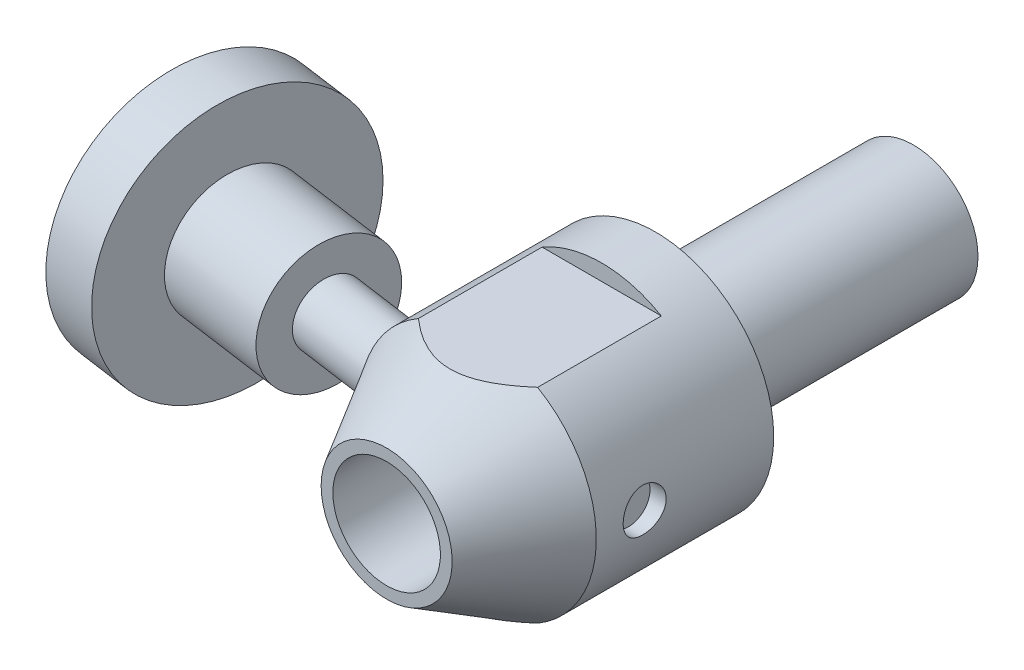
ISO-10303-21;
HEADER;
FILE_DESCRIPTION(('STEP AP214'),'2;1');
FILE_NAME('part.step','',(''),(''),'','','');
FILE_SCHEMA(('AUTOMOTIVE_DESIGN { 1 0 10303 214 1 1 1 1 }'));
ENDSEC;
DATA;
#1=APPLICATION_CONTEXT('core data for automotive mechanical design processes');
#2=APPLICATION_PROTOCOL_DEFINITION('international standard','automotive_design',2000,#1);
#3=PRODUCT_CONTEXT('',#1,'mechanical');
#4=PRODUCT('Part','Part','',(#3));
#5=PRODUCT_RELATED_PRODUCT_CATEGORY('part','',(#4));
#6=PRODUCT_DEFINITION_FORMATION('','',#4);
#7=PRODUCT_DEFINITION_CONTEXT('part definition',#1,'design');
#8=PRODUCT_DEFINITION('design','',#6,#7);
#9=PRODUCT_DEFINITION_SHAPE('','',#8);
#10=(LENGTH_UNIT() NAMED_UNIT(*) SI_UNIT(.MILLI.,.METRE.));
#11=(NAMED_UNIT(*) PLANE_ANGLE_UNIT() SI_UNIT($,.RADIAN.));
#12=(NAMED_UNIT(*) SI_UNIT($,.STERADIAN.) SOLID_ANGLE_UNIT());
#13=UNCERTAINTY_MEASURE_WITH_UNIT(LENGTH_MEASURE(1.E-05),#10,'distance_accuracy_value','');
#14=(GEOMETRIC_REPRESENTATION_CONTEXT(3) GLOBAL_UNCERTAINTY_ASSIGNED_CONTEXT((#13)) GLOBAL_UNIT_ASSIGNED_CONTEXT((#10,
#11,#12)) REPRESENTATION_CONTEXT('',''));
#15=CARTESIAN_POINT('',(0.,0.,0.));
#16=DIRECTION('',(0.,0.,1.));
#17=DIRECTION('',(1.,0.,0.));
#18=AXIS2_PLACEMENT_3D('',#15,#16,#17);
#19=CARTESIAN_POINT('',(9.5,0.,14.));
#20=DIRECTION('',(-1.,0.,0.));
#21=DIRECTION('',(0.,0.,1.));
#22=AXIS2_PLACEMENT_3D('',#19,#20,#21);
#23=PLANE('',#22);
#24=CARTESIAN_POINT('',(9.5,0.,12.));
#25=DIRECTION('',(1.,0.,0.));
#26=DIRECTION('',(0.,0.,-1.));
#27=AXIS2_PLACEMENT_3D('',#24,#25,#26);
#28=CIRCLE('',#27,2.);
#29=CARTESIAN_POINT('',(9.5,0.,10.));
#30=VERTEX_POINT('',#29);
#31=EDGE_CURVE('E59',#30,#30,#28,.T.);
#32=ORIENTED_EDGE('',*,*,#31,.T.);
#33=EDGE_LOOP('',(#32));
#34=FACE_BOUND('',#33,.T.);
#35=ADVANCED_FACE('F14',(#34),#23,.F.);
#36=CARTESIAN_POINT('',(-29.4859678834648,0.,9.40196664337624));
#37=DIRECTION('',(0.99026806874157,0.,0.139173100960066));
#38=DIRECTION('',(0.139173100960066,0.,-0.99026806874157));
#39=AXIS2_PLACEMENT_3D('',#36,#37,#38);
#40=PLANE('',#39);
#41=CARTESIAN_POINT('',(-29.4859678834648,0.,9.40196664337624));
#42=DIRECTION('',(-0.99026806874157,0.,-0.139173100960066));
#43=DIRECTION('',(-0.139173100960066,0.,0.99026806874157));
#44=AXIS2_PLACEMENT_3D('',#41,#42,#43);
#45=CIRCLE('',#44,3.);
#46=CARTESIAN_POINT('',(-29.0684485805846,0.,6.43116243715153));
#47=VERTEX_POINT('',#46);
#48=EDGE_CURVE('E137',#47,#47,#45,.T.);
#49=ORIENTED_EDGE('',*,*,#48,.T.);
#50=EDGE_LOOP('',(#49));
#51=FACE_BOUND('',#50,.T.);
#52=ADVANCED_FACE('F114',(#51),#40,.F.);
#53=CARTESIAN_POINT('',(-34.4373082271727,0.,8.70610113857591));
#54=DIRECTION('',(0.99026806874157,0.,0.139173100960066));
#55=DIRECTION('',(0.139173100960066,0.,-0.99026806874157));
#56=AXIS2_PLACEMENT_3D('',#53,#54,#55);
#57=CYLINDRICAL_SURFACE('',#56,3.);
#58=CARTESIAN_POINT('',(-34.4373082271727,0.,8.70610113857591));
#59=DIRECTION('',(0.99026806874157,0.,0.139173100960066));
#60=DIRECTION('',(0.139173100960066,0.,-0.99026806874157));
#61=AXIS2_PLACEMENT_3D('',#58,#59,#60);
#62=CIRCLE('',#61,3.);
#63=CARTESIAN_POINT('',(-34.0197889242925,0.,5.7352969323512));
#64=VERTEX_POINT('',#63);
#65=EDGE_CURVE('E221',#64,#64,#62,.T.);
#66=CARTESIAN_POINT('',(-34.0197889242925,0.,5.7352969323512));
#67=CARTESIAN_POINT('',(-33.9682124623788,0.,5.74254553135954));
#68=CARTESIAN_POINT('',(-33.9166360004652,0.,5.74979413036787));
#69=CARTESIAN_POINT('',(-33.813483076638,0.,5.76429132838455));
#70=CARTESIAN_POINT('',(-33.7619066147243,0.,5.77153992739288));
#71=CARTESIAN_POINT('',(-33.6587536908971,0.,5.78603712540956));
#72=CARTESIAN_POINT('',(-33.6071772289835,0.,5.79328572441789));
#73=CARTESIAN_POINT('',(-33.5040243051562,0.,5.80778292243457));
#74=CARTESIAN_POINT('',(-33.4524478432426,0.,5.81503152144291));
#75=CARTESIAN_POINT('',(-33.3492949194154,0.,5.82952871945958));
#76=CARTESIAN_POINT('',(-33.2977184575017,0.,5.83677731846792));
#77=CARTESIAN_POINT('',(-33.1945655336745,0.,5.85127451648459));
#78=CARTESIAN_POINT('',(-33.1429890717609,0.,5.85852311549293));
#79=CARTESIAN_POINT('',(-33.0398361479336,0.,5.8730203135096));
#80=CARTESIAN_POINT('',(-32.98825968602,0.,5.88026891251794));
#81=CARTESIAN_POINT('',(-32.8851067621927,0.,5.89476611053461));
#82=CARTESIAN_POINT('',(-32.8335303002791,0.,5.90201470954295));
#83=CARTESIAN_POINT('',(-32.7303773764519,0.,5.91651190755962));
#84=CARTESIAN_POINT('',(-32.6788009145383,0.,5.92376050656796));
#85=CARTESIAN_POINT('',(-32.575647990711,0.,5.93825770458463));
#86=CARTESIAN_POINT('',(-32.5240715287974,0.,5.94550630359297));
#87=CARTESIAN_POINT('',(-32.4209186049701,0.,5.96000350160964));
#88=CARTESIAN_POINT('',(-32.3693421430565,0.,5.96725210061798));
#89=CARTESIAN_POINT('',(-32.2661892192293,0.,5.98174929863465));
#90=CARTESIAN_POINT('',(-32.2146127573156,0.,5.98899789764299));
#91=CARTESIAN_POINT('',(-32.1114598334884,0.,6.00349509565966));
#92=CARTESIAN_POINT('',(-32.0598833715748,0.,6.010743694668));
#93=CARTESIAN_POINT('',(-31.9567304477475,0.,6.02524089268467));
#94=CARTESIAN_POINT('',(-31.9051539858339,0.,6.03248949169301));
#95=CARTESIAN_POINT('',(-31.8020010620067,0.,6.04698668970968));
#96=CARTESIAN_POINT('',(-31.750424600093,0.,6.05423528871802));
#97=CARTESIAN_POINT('',(-31.6472716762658,0.,6.06873248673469));
#98=CARTESIAN_POINT('',(-31.5956952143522,0.,6.07598108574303));
#99=CARTESIAN_POINT('',(-31.4925422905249,0.,6.0904782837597));
#100=CARTESIAN_POINT('',(-31.4409658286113,0.,6.09772688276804));
#101=CARTESIAN_POINT('',(-31.337812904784,0.,6.11222408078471));
#102=CARTESIAN_POINT('',(-31.2862364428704,0.,6.11947267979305));
#103=CARTESIAN_POINT('',(-31.1830835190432,0.,6.13396987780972));
#104=CARTESIAN_POINT('',(-31.1315070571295,0.,6.14121847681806));
#105=CARTESIAN_POINT('',(-31.0283541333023,0.,6.15571567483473));
#106=CARTESIAN_POINT('',(-30.9767776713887,0.,6.16296427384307));
#107=CARTESIAN_POINT('',(-30.8736247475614,0.,6.17746147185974));
#108=CARTESIAN_POINT('',(-30.8220482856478,0.,6.18471007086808));
#109=CARTESIAN_POINT('',(-30.7188953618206,0.,6.19920726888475));
#110=CARTESIAN_POINT('',(-30.6673188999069,0.,6.20645586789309));
#111=CARTESIAN_POINT('',(-30.5641659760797,0.,6.22095306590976));
#112=CARTESIAN_POINT('',(-30.5125895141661,0.,6.2282016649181));
#113=CARTESIAN_POINT('',(-30.4094365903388,0.,6.24269886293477));
#114=CARTESIAN_POINT('',(-30.3578601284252,0.,6.24994746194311));
#115=CARTESIAN_POINT('',(-30.2547072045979,0.,6.26444465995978));
#116=CARTESIAN_POINT('',(-30.2031307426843,0.,6.27169325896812));
#117=CARTESIAN_POINT('',(-30.0999778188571,0.,6.2861904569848));
#118=CARTESIAN_POINT('',(-30.0484013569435,0.,6.29343905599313));
#119=CARTESIAN_POINT('',(-29.9452484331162,0.,6.30793625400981));
#120=CARTESIAN_POINT('',(-29.8936719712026,0.,6.31518485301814));
#121=CARTESIAN_POINT('',(-29.7905190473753,0.,6.32968205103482));
#122=CARTESIAN_POINT('',(-29.7389425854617,0.,6.33693065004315));
#123=CARTESIAN_POINT('',(-29.6357896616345,0.,6.35142784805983));
#124=CARTESIAN_POINT('',(-29.5842131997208,0.,6.35867644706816));
#125=CARTESIAN_POINT('',(-29.4810602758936,0.,6.37317364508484));
#126=CARTESIAN_POINT('',(-29.42948381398,0.,6.38042224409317));
#127=CARTESIAN_POINT('',(-29.3263308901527,0.,6.39491944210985));
#128=CARTESIAN_POINT('',(-29.2747544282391,0.,6.40216804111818));
#129=CARTESIAN_POINT('',(-29.1716015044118,0.,6.41666523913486));
#130=CARTESIAN_POINT('',(-29.1200250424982,0.,6.42391383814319));
#131=CARTESIAN_POINT('',(-29.0684485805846,0.,6.43116243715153));
#132=B_SPLINE_CURVE_WITH_KNOTS('',3,(#66,#67,#68,#69,#70,#71,#72,#73,#74,#75,#76,#77,#78,#79,
#80,#81,#82,#83,#84,#85,#86,#87,#88,#89,#90,#91,#92,#93,#94,#95,#96,#97,#98,#99,#100,#101,#102,
#103,#104,#105,#106,#107,#108,#109,#110,#111,#112,#113,#114,#115,#116,#117,#118,#119,#120,#121,
#122,#123,#124,#125,#126,#127,#128,#129,#130,#131),.UNSPECIFIED.,.F.,.F.,(4,2,2,2,2,2,2,2,2,2,2,
2,2,2,2,2,2,2,2,2,2,2,2,2,2,2,2,2,2,2,2,2,4),(0.,0.156250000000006,0.312500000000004,
0.468750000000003,0.625000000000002,0.781250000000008,0.937500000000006,1.09375000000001,1.25,
1.40625,1.56250000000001,1.71875000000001,1.87500000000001,2.03125,2.1875,2.34375000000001,
2.50000000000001,2.65625000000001,2.81250000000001,2.96875000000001,3.12500000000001,
3.28125000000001,3.43750000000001,3.59375000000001,3.75000000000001,3.90625000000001,
4.06250000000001,4.21875000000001,4.37500000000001,4.53125000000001,4.68750000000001,
4.84375000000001,5.00000000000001),.UNSPECIFIED.);
#133=EDGE_CURVE('BSEAM118',#64,#47,#132,.T.);
#134=ORIENTED_EDGE('',*,*,#65,.F.);
#135=ORIENTED_EDGE('',*,*,#48,.F.);
#136=ORIENTED_EDGE('',*,*,#133,.T.);
#137=ORIENTED_EDGE('',*,*,#133,.F.);
#138=EDGE_LOOP('',(#134,#136,#135,#137));
#139=FACE_BOUND('',#138,.T.);
#140=ADVANCED_FACE('F118',(#139),#57,.F.);
#141=CARTESIAN_POINT('',(-34.4373082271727,12.,8.70610113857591));
#142=DIRECTION('',(-0.99026806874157,0.,-0.139173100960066));
#143=DIRECTION('',(-0.139173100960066,0.,0.99026806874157));
#144=AXIS2_PLACEMENT_3D('',#141,#142,#143);
#145=PLANE('',#144);
#146=ORIENTED_EDGE('',*,*,#65,.T.);
#147=EDGE_LOOP('',(#146));
#148=FACE_BOUND('',#147,.T.);
#149=CARTESIAN_POINT('',(-34.4373082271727,0.,8.70610113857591));
#150=DIRECTION('',(0.99026806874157,0.,0.139173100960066));
#151=DIRECTION('',(0.139173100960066,0.,-0.99026806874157));
#152=AXIS2_PLACEMENT_3D('',#149,#150,#151);
#153=CIRCLE('',#152,12.);
#154=CARTESIAN_POINT('',(-32.7672310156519,0.,-3.17711568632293));
#155=VERTEX_POINT('',#154);
#156=EDGE_CURVE('E226',#155,#155,#153,.T.);
#157=ORIENTED_EDGE('',*,*,#156,.F.);
#158=EDGE_LOOP('',(#157));
#159=FACE_BOUND('',#158,.T.);
#160=ADVANCED_FACE('F245',(#148,#159),#145,.T.);
#161=CARTESIAN_POINT('',(-9.68060650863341,0.,12.1854286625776));
#162=DIRECTION('',(0.99026806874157,0.,0.139173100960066));
#163=DIRECTION('',(0.139173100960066,0.,-0.99026806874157));
#164=AXIS2_PLACEMENT_3D('',#161,#162,#163);
#165=CYLINDRICAL_SURFACE('',#164,12.);
#166=CARTESIAN_POINT('',(-29.4859678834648,0.,9.40196664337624));
#167=DIRECTION('',(0.99026806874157,0.,0.139173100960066));
#168=DIRECTION('',(0.139173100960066,0.,-0.99026806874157));
#169=AXIS2_PLACEMENT_3D('',#166,#167,#168);
#170=CIRCLE('',#169,12.);
#171=CARTESIAN_POINT('',(-27.8158906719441,0.,-2.48125018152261));
#172=VERTEX_POINT('',#171);
#173=EDGE_CURVE('E233',#172,#172,#170,.T.);
#174=CARTESIAN_POINT('',(-32.7672310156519,0.,-3.17711568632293));
#175=CARTESIAN_POINT('',(-32.7156545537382,0.,-3.16986708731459));
#176=CARTESIAN_POINT('',(-32.6640780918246,0.,-3.16261848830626));
#177=CARTESIAN_POINT('',(-32.5609251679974,0.,-3.14812129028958));
#178=CARTESIAN_POINT('',(-32.5093487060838,0.,-3.14087269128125));
#179=CARTESIAN_POINT('',(-32.4061957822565,0.,-3.12637549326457));
#180=CARTESIAN_POINT('',(-32.3546193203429,0.,-3.11912689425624));
#181=CARTESIAN_POINT('',(-32.2514663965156,0.,-3.10462969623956));
#182=CARTESIAN_POINT('',(-32.199889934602,0.,-3.09738109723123));
#183=CARTESIAN_POINT('',(-32.0967370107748,0.,-3.08288389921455));
#184=CARTESIAN_POINT('',(-32.0451605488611,0.,-3.07563530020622));
#185=CARTESIAN_POINT('',(-31.9420076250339,0.,-3.06113810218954));
#186=CARTESIAN_POINT('',(-31.8904311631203,0.,-3.05388950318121));
#187=CARTESIAN_POINT('',(-31.787278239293,0.,-3.03939230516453));
#188=CARTESIAN_POINT('',(-31.7357017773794,0.,-3.0321437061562));
#189=CARTESIAN_POINT('',(-31.6325488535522,0.,-3.01764650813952));
#190=CARTESIAN_POINT('',(-31.5809723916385,0.,-3.01039790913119));
#191=CARTESIAN_POINT('',(-31.4778194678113,0.,-2.99590071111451));
#192=CARTESIAN_POINT('',(-31.4262430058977,0.,-2.98865211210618));
#193=CARTESIAN_POINT('',(-31.3230900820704,0.,-2.9741549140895));
#194=CARTESIAN_POINT('',(-31.2715136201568,0.,-2.96690631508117));
#195=CARTESIAN_POINT('',(-31.1683606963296,0.,-2.95240911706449));
#196=CARTESIAN_POINT('',(-31.1167842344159,0.,-2.94516051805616));
#197=CARTESIAN_POINT('',(-31.0136313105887,0.,-2.93066332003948));
#198=CARTESIAN_POINT('',(-30.9620548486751,0.,-2.92341472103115));
#199=CARTESIAN_POINT('',(-30.8589019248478,0.,-2.90891752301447));
#200=CARTESIAN_POINT('',(-30.8073254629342,0.,-2.90166892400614));
#201=CARTESIAN_POINT('',(-30.7041725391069,0.,-2.88717172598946));
#202=CARTESIAN_POINT('',(-30.6525960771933,0.,-2.87992312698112));
#203=CARTESIAN_POINT('',(-30.5494431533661,0.,-2.86542592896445));
#204=CARTESIAN_POINT('',(-30.4978666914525,0.,-2.85817732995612));
#205=CARTESIAN_POINT('',(-30.3947137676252,0.,-2.84368013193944));
#206=CARTESIAN_POINT('',(-30.3431373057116,0.,-2.83643153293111));
#207=CARTESIAN_POINT('',(-30.2399843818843,0.,-2.82193433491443));
#208=CARTESIAN_POINT('',(-30.1884079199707,0.,-2.8146857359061));
#209=CARTESIAN_POINT('',(-30.0852549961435,0.,-2.80018853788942));
#210=CARTESIAN_POINT('',(-30.0336785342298,0.,-2.79293993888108));
#211=CARTESIAN_POINT('',(-29.9305256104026,0.,-2.77844274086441));
#212=CARTESIAN_POINT('',(-29.878949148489,0.,-2.77119414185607));
#213=CARTESIAN_POINT('',(-29.7757962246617,0.,-2.7566969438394));
#214=CARTESIAN_POINT('',(-29.7242197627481,0.,-2.74944834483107));
#215=CARTESIAN_POINT('',(-29.6210668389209,0.,-2.73495114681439));
#216=CARTESIAN_POINT('',(-29.5694903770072,0.,-2.72770254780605));
#217=CARTESIAN_POINT('',(-29.46633745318,0.,-2.71320534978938));
#218=CARTESIAN_POINT('',(-29.4147609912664,0.,-2.70595675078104));
#219=CARTESIAN_POINT('',(-29.3116080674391,0.,-2.69145955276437));
#220=CARTESIAN_POINT('',(-29.2600316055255,0.,-2.68421095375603));
#221=CARTESIAN_POINT('',(-29.1568786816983,0.,-2.66971375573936));
#222=CARTESIAN_POINT('',(-29.1053022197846,0.,-2.66246515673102));
#223=CARTESIAN_POINT('',(-29.0021492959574,0.,-2.64796795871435));
#224=CARTESIAN_POINT('',(-28.9505728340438,0.,-2.64071935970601));
#225=CARTESIAN_POINT('',(-28.8474199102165,0.,-2.62622216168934));
#226=CARTESIAN_POINT('',(-28.7958434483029,0.,-2.618973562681));
#227=CARTESIAN_POINT('',(-28.6926905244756,0.,-2.60447636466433));
#228=CARTESIAN_POINT('',(-28.641114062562,0.,-2.59722776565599));
#229=CARTESIAN_POINT('',(-28.5379611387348,0.,-2.58273056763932));
#230=CARTESIAN_POINT('',(-28.4863846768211,0.,-2.57548196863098));
#231=CARTESIAN_POINT('',(-28.3832317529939,0.,-2.56098477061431));
#232=CARTESIAN_POINT('',(-28.3316552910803,0.,-2.55373617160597));
#233=CARTESIAN_POINT('',(-28.228502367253,0.,-2.5392389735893));
#234=CARTESIAN_POINT('',(-28.1769259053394,0.,-2.53199037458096));
#235=CARTESIAN_POINT('',(-28.0737729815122,0.,-2.51749317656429));
#236=CARTESIAN_POINT('',(-28.0221965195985,0.,-2.51024457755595));
#237=CARTESIAN_POINT('',(-27.9190435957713,0.,-2.49574737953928));
#238=CARTESIAN_POINT('',(-27.8674671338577,0.,-2.48849878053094));
#239=CARTESIAN_POINT('',(-27.8158906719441,0.,-2.48125018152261));
#240=B_SPLINE_CURVE_WITH_KNOTS('',3,(#174,#175,#176,#177,#178,#179,#180,#181,#182,#183,#184,
#185,#186,#187,#188,#189,#190,#191,#192,#193,#194,#195,#196,#197,#198,#199,#200,#201,#202,#203,
#204,#205,#206,#207,#208,#209,#210,#211,#212,#213,#214,#215,#216,#217,#218,#219,#220,#221,#222,
#223,#224,#225,#226,#227,#228,#229,#230,#231,#232,#233,#234,#235,#236,#237,#238,#239),
.UNSPECIFIED.,.F.,.F.,(4,2,2,2,2,2,2,2,2,2,2,2,2,2,2,2,2,2,2,2,2,2,2,2,2,2,2,2,2,2,2,2,4),(0.,
0.156249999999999,0.312499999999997,0.468749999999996,0.624999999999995,0.781249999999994,
0.937499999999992,1.09374999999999,1.24999999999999,1.40624999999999,1.56249999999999,
1.71874999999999,1.87499999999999,2.03124999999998,2.18749999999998,2.34374999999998,
2.49999999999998,2.65624999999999,2.81249999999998,2.96874999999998,3.12499999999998,
3.28124999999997,3.43749999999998,3.59374999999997,3.74999999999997,3.90624999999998,
4.06249999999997,4.21874999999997,4.37499999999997,4.53124999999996,4.68749999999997,
4.84374999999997,4.99999999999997),.UNSPECIFIED.);
#241=EDGE_CURVE('BSEAM120',#155,#172,#240,.T.);
#242=ORIENTED_EDGE('',*,*,#156,.T.);
#243=ORIENTED_EDGE('',*,*,#173,.F.);
#244=ORIENTED_EDGE('',*,*,#241,.T.);
#245=ORIENTED_EDGE('',*,*,#241,.F.);
#246=EDGE_LOOP('',(#242,#244,#243,#245));
#247=FACE_BOUND('',#246,.T.);
#248=ADVANCED_FACE('F120',(#247),#165,.T.);
#249=CARTESIAN_POINT('',(-29.4859678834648,6.,9.40196664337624));
#250=DIRECTION('',(0.99026806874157,0.,0.139173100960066));
#251=DIRECTION('',(0.139173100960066,0.,-0.99026806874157));
#252=AXIS2_PLACEMENT_3D('',#249,#250,#251);
#253=PLANE('',#252);
#254=ORIENTED_EDGE('',*,*,#173,.T.);
#255=EDGE_LOOP('',(#254));
#256=FACE_BOUND('',#255,.T.);
#257=CARTESIAN_POINT('',(-29.4859678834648,0.,9.40196664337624));
#258=DIRECTION('',(0.99026806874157,0.,0.139173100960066));
#259=DIRECTION('',(0.139173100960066,0.,-0.99026806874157));
#260=AXIS2_PLACEMENT_3D('',#257,#258,#259);
#261=CIRCLE('',#260,6.);
#262=CARTESIAN_POINT('',(-28.6509292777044,0.,3.46035823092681));
#263=VERTEX_POINT('',#262);
#264=EDGE_CURVE('E235',#263,#263,#261,.T.);
#265=ORIENTED_EDGE('',*,*,#264,.F.);
#266=EDGE_LOOP('',(#265));
#267=FACE_BOUND('',#266,.T.);
#268=ADVANCED_FACE('F194',(#256,#267),#253,.T.);
#269=CARTESIAN_POINT('',(4.5,0.,-24.));
#270=DIRECTION('',(0.,0.,1.));
#271=DIRECTION('',(1.,0.,0.));
#272=AXIS2_PLACEMENT_3D('',#269,#270,#271);
#273=PLANE('',#272);
#274=CARTESIAN_POINT('',(0.,0.,-24.));
#275=DIRECTION('',(0.,0.,1.));
#276=DIRECTION('',(1.,0.,0.));
#277=AXIS2_PLACEMENT_3D('',#274,#275,#276);
#278=CIRCLE('',#277,6.);
#279=CARTESIAN_POINT('',(6.,0.,-24.));
#280=VERTEX_POINT('',#279);
#281=EDGE_CURVE('E140',#280,#280,#278,.F.);
#282=ORIENTED_EDGE('',*,*,#281,.T.);
#283=EDGE_LOOP('',(#282));
#284=FACE_BOUND('',#283,.T.);
#285=ADVANCED_FACE('F16',(#284),#273,.F.);
#286=CARTESIAN_POINT('',(-9.68060650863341,0.,12.1854286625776));
#287=DIRECTION('',(0.99026806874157,0.,0.139173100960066));
#288=DIRECTION('',(0.139173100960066,0.,-0.99026806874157));
#289=AXIS2_PLACEMENT_3D('',#286,#287,#288);
#290=CYLINDRICAL_SURFACE('',#289,6.);
#291=CARTESIAN_POINT('',(-19.5832871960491,0.,10.7936976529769));
#292=DIRECTION('',(0.99026806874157,0.,0.139173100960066));
#293=DIRECTION('',(0.139173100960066,0.,-0.99026806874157));
#294=AXIS2_PLACEMENT_3D('',#291,#292,#293);
#295=CIRCLE('',#294,6.);
#296=CARTESIAN_POINT('',(-18.7482485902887,0.,4.85208924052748));
#297=VERTEX_POINT('',#296);
#298=EDGE_CURVE('E138',#297,#297,#295,.T.);
#299=CARTESIAN_POINT('',(-28.6509292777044,0.,3.46035823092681));
#300=CARTESIAN_POINT('',(-28.5477763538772,0.,3.47485542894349));
#301=CARTESIAN_POINT('',(-28.44462343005,0.,3.48935262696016));
#302=CARTESIAN_POINT('',(-28.2383175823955,0.,3.51834702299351));
#303=CARTESIAN_POINT('',(-28.1351646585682,0.,3.53284422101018));
#304=CARTESIAN_POINT('',(-27.9288588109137,0.,3.56183861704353));
#305=CARTESIAN_POINT('',(-27.8257058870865,0.,3.5763358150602));
#306=CARTESIAN_POINT('',(-27.619400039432,0.,3.60533021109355));
#307=CARTESIAN_POINT('',(-27.5162471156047,0.,3.61982740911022));
#308=CARTESIAN_POINT('',(-27.3099412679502,0.,3.64882180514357));
#309=CARTESIAN_POINT('',(-27.206788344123,0.,3.66331900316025));
#310=CARTESIAN_POINT('',(-27.0004824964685,0.,3.69231339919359));
#311=CARTESIAN_POINT('',(-26.8973295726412,0.,3.70681059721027));
#312=CARTESIAN_POINT('',(-26.6910237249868,0.,3.73580499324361));
#313=CARTESIAN_POINT('',(-26.5878708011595,0.,3.75030219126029));
#314=CARTESIAN_POINT('',(-26.381564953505,0.,3.77929658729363));
#315=CARTESIAN_POINT('',(-26.2784120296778,0.,3.79379378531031));
#316=CARTESIAN_POINT('',(-26.0721061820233,0.,3.82278818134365));
#317=CARTESIAN_POINT('',(-25.968953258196,0.,3.83728537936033));
#318=CARTESIAN_POINT('',(-25.7626474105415,0.,3.86627977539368));
#319=CARTESIAN_POINT('',(-25.6594944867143,0.,3.88077697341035));
#320=CARTESIAN_POINT('',(-25.4531886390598,0.,3.9097713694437));
#321=CARTESIAN_POINT('',(-25.3500357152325,0.,3.92426856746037));
#322=CARTESIAN_POINT('',(-25.143729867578,0.,3.95326296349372));
#323=CARTESIAN_POINT('',(-25.0405769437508,0.,3.96776016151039));
#324=CARTESIAN_POINT('',(-24.8342710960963,0.,3.99675455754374));
#325=CARTESIAN_POINT('',(-24.7311181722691,0.,4.01125175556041));
#326=CARTESIAN_POINT('',(-24.5248123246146,0.,4.04024615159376));
#327=CARTESIAN_POINT('',(-24.4216594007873,0.,4.05474334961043));
#328=CARTESIAN_POINT('',(-24.2153535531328,0.,4.08373774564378));
#329=CARTESIAN_POINT('',(-24.1122006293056,0.,4.09823494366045));
#330=CARTESIAN_POINT('',(-23.9058947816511,0.,4.1272293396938));
#331=CARTESIAN_POINT('',(-23.8027418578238,0.,4.14172653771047));
#332=CARTESIAN_POINT('',(-23.5964360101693,0.,4.17072093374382));
#333=CARTESIAN_POINT('',(-23.4932830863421,0.,4.18521813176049));
#334=CARTESIAN_POINT('',(-23.2869772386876,0.,4.21421252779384));
#335=CARTESIAN_POINT('',(-23.1838243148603,0.,4.22870972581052));
#336=CARTESIAN_POINT('',(-22.9775184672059,0.,4.25770412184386));
#337=CARTESIAN_POINT('',(-22.8743655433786,0.,4.27220131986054));
#338=CARTESIAN_POINT('',(-22.6680596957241,0.,4.30119571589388));
#339=CARTESIAN_POINT('',(-22.5649067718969,0.,4.31569291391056));
#340=CARTESIAN_POINT('',(-22.3586009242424,0.,4.3446873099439));
#341=CARTESIAN_POINT('',(-22.2554480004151,0.,4.35918450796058));
#342=CARTESIAN_POINT('',(-22.0491421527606,0.,4.38817890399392));
#343=CARTESIAN_POINT('',(-21.9459892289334,0.,4.4026761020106));
#344=CARTESIAN_POINT('',(-21.7396833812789,0.,4.43167049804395));
#345=CARTESIAN_POINT('',(-21.6365304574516,0.,4.44616769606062));
#346=CARTESIAN_POINT('',(-21.4302246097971,0.,4.47516209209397));
#347=CARTESIAN_POINT('',(-21.3270716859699,0.,4.48965929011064));
#348=CARTESIAN_POINT('',(-21.1207658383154,0.,4.51865368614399));
#349=CARTESIAN_POINT('',(-21.0176129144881,0.,4.53315088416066));
#350=CARTESIAN_POINT('',(-20.8113070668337,0.,4.56214528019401));
#351=CARTESIAN_POINT('',(-20.7081541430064,0.,4.57664247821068));
#352=CARTESIAN_POINT('',(-20.5018482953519,0.,4.60563687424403));
#353=CARTESIAN_POINT('',(-20.3986953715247,0.,4.6201340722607));
#354=CARTESIAN_POINT('',(-20.1923895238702,0.,4.64912846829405));
#355=CARTESIAN_POINT('',(-20.0892366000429,0.,4.66362566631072));
#356=CARTESIAN_POINT('',(-19.8829307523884,0.,4.69262006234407));
#357=CARTESIAN_POINT('',(-19.7797778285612,0.,4.70711726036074));
#358=CARTESIAN_POINT('',(-19.5734719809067,0.,4.73611165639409));
#359=CARTESIAN_POINT('',(-19.4703190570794,0.,4.75060885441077));
#360=CARTESIAN_POINT('',(-19.2640132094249,0.,4.77960325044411));
#361=CARTESIAN_POINT('',(-19.1608602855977,0.,4.79410044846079));
#362=CARTESIAN_POINT('',(-18.9545544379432,0.,4.82309484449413));
#363=CARTESIAN_POINT('',(-18.851401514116,0.,4.83759204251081));
#364=CARTESIAN_POINT('',(-18.7482485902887,0.,4.85208924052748));
#365=B_SPLINE_CURVE_WITH_KNOTS('',3,(#299,#300,#301,#302,#303,#304,#305,#306,#307,#308,#309,
#310,#311,#312,#313,#314,#315,#316,#317,#318,#319,#320,#321,#322,#323,#324,#325,#326,#327,#328,
#329,#330,#331,#332,#333,#334,#335,#336,#337,#338,#339,#340,#341,#342,#343,#344,#345,#346,#347,
#348,#349,#350,#351,#352,#353,#354,#355,#356,#357,#358,#359,#360,#361,#362,#363,#364),
.UNSPECIFIED.,.F.,.F.,(4,2,2,2,2,2,2,2,2,2,2,2,2,2,2,2,2,2,2,2,2,2,2,2,2,2,2,2,2,2,2,2,4),(0.,
0.312499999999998,0.625000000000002,0.9375,1.25,1.5625,1.87500000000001,2.1875,2.50000000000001,
2.81250000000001,3.12500000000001,3.43750000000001,3.75000000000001,4.06250000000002,
4.37500000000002,4.68750000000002,5.00000000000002,5.31250000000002,5.62500000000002,
5.93750000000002,6.25000000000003,6.56250000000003,6.87500000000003,7.18750000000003,
7.50000000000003,7.81250000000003,8.12500000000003,8.43750000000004,8.75000000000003,
9.06250000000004,9.37500000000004,9.68750000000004,10.),.UNSPECIFIED.);
#366=EDGE_CURVE('BSEAM165',#263,#297,#365,.T.);
#367=ORIENTED_EDGE('',*,*,#264,.T.);
#368=ORIENTED_EDGE('',*,*,#298,.F.);
#369=ORIENTED_EDGE('',*,*,#366,.T.);
#370=ORIENTED_EDGE('',*,*,#366,.F.);
#371=EDGE_LOOP('',(#367,#369,#368,#370));
#372=FACE_BOUND('',#371,.T.);
#373=ADVANCED_FACE('F165',(#372),#290,.T.);
#374=CARTESIAN_POINT('',(2.1,0.,3.));
#375=DIRECTION('',(0.,0.,-1.));
#376=DIRECTION('',(-1.,0.,0.));
#377=AXIS2_PLACEMENT_3D('',#374,#375,#376);
#378=PLANE('',#377);
#379=CARTESIAN_POINT('',(0.,0.,3.));
#380=DIRECTION('',(0.,0.,-1.));
#381=DIRECTION('',(-1.,0.,0.));
#382=AXIS2_PLACEMENT_3D('',#379,#380,#381);
#383=CIRCLE('',#382,5.);
#384=CARTESIAN_POINT('',(-5.,0.,3.));
#385=VERTEX_POINT('',#384);
#386=EDGE_CURVE('E154',#385,#385,#383,.T.);
#387=ORIENTED_EDGE('',*,*,#386,.F.);
#388=EDGE_LOOP('',(#387));
#389=FACE_BOUND('',#388,.T.);
#390=ADVANCED_FACE('F127',(#389),#378,.F.);
#391=CARTESIAN_POINT('',(5.,0.,25.));
#392=DIRECTION('',(0.,0.,-1.));
#393=DIRECTION('',(-1.,0.,0.));
#394=AXIS2_PLACEMENT_3D('',#391,#392,#393);
#395=PLANE('',#394);
#396=CARTESIAN_POINT('',(0.,0.,25.));
#397=DIRECTION('',(0.,0.,-1.));
#398=DIRECTION('',(-1.,0.,0.));
#399=AXIS2_PLACEMENT_3D('',#396,#397,#398);
#400=CIRCLE('',#399,6.09252271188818);
#401=CARTESIAN_POINT('',(-6.09252271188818,0.,25.));
#402=VERTEX_POINT('',#401);
#403=EDGE_CURVE('E209',#402,#402,#400,.T.);
#404=ORIENTED_EDGE('',*,*,#403,.F.);
#405=EDGE_LOOP('',(#404));
#406=FACE_BOUND('',#405,.T.);
#407=CARTESIAN_POINT('',(0.,0.,25.));
#408=DIRECTION('',(0.,0.,-1.));
#409=DIRECTION('',(-1.,0.,0.));
#410=AXIS2_PLACEMENT_3D('',#407,#408,#409);
#411=CIRCLE('',#410,5.);
#412=CARTESIAN_POINT('',(-5.,0.,25.));
#413=VERTEX_POINT('',#412);
#414=EDGE_CURVE('E213',#413,#413,#411,.T.);
#415=ORIENTED_EDGE('',*,*,#414,.T.);
#416=EDGE_LOOP('',(#415));
#417=FACE_BOUND('',#416,.T.);
#418=ADVANCED_FACE('F145',(#406,#417),#395,.F.);
#419=CARTESIAN_POINT('',(0.,0.,-48.3091160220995));
#420=DIRECTION('',(0.,0.,-1.));
#421=DIRECTION('',(-1.,0.,0.));
#422=AXIS2_PLACEMENT_3D('',#419,#420,#421);
#423=CYLINDRICAL_SURFACE('',#422,5.);
#424=ORIENTED_EDGE('',*,*,#414,.F.);
#425=EDGE_LOOP('',(#424));
#426=FACE_BOUND('',#425,.T.);
#427=ORIENTED_EDGE('',*,*,#386,.T.);
#428=EDGE_LOOP('',(#427));
#429=FACE_BOUND('',#428,.T.);
#430=ADVANCED_FACE('F167',(#426,#429),#423,.F.);
#431=CARTESIAN_POINT('',(0.,0.,-48.3091160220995));
#432=DIRECTION('',(0.,0.,-1.));
#433=DIRECTION('',(-1.,0.,0.));
#434=AXIS2_PLACEMENT_3D('',#431,#432,#433);
#435=CYLINDRICAL_SURFACE('',#434,6.);
#436=CARTESIAN_POINT('',(0.,0.,0.));
#437=DIRECTION('',(0.,0.,1.));
#438=DIRECTION('',(1.,0.,0.));
#439=AXIS2_PLACEMENT_3D('',#436,#437,#438);
#440=CIRCLE('',#439,6.);
#441=CARTESIAN_POINT('',(6.,0.,0.));
#442=VERTEX_POINT('',#441);
#443=EDGE_CURVE('E155',#442,#442,#440,.T.);
#444=ORIENTED_EDGE('',*,*,#443,.F.);
#445=EDGE_LOOP('',(#444));
#446=FACE_BOUND('',#445,.T.);
#447=ORIENTED_EDGE('',*,*,#281,.F.);
#448=EDGE_LOOP('',(#447));
#449=FACE_BOUND('',#448,.T.);
#450=ADVANCED_FACE('F169',(#446,#449),#435,.T.);
#451=CARTESIAN_POINT('',(-19.5832871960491,0.,10.7936976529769));
#452=DIRECTION('',(0.99026806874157,0.,0.139173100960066));
#453=DIRECTION('',(0.139173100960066,0.,-0.99026806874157));
#454=AXIS2_PLACEMENT_3D('',#451,#452,#453);
#455=PLANE('',#454);
#456=ORIENTED_EDGE('',*,*,#298,.T.);
#457=EDGE_LOOP('',(#456));
#458=FACE_BOUND('',#457,.T.);
#459=CARTESIAN_POINT('',(-19.5832871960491,0.,10.7936976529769));
#460=DIRECTION('',(0.99026806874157,0.,0.139173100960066));
#461=DIRECTION('',(0.,-1.,0.));
#462=AXIS2_PLACEMENT_3D('',#459,#460,#461);
#463=CIRCLE('',#462,3.);
#464=CARTESIAN_POINT('',(-19.5832871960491,-3.,10.7936976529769));
#465=VERTEX_POINT('',#464);
#466=EDGE_CURVE('E217',#465,#465,#463,.F.);
#467=ORIENTED_EDGE('',*,*,#466,.T.);
#468=EDGE_LOOP('',(#467));
#469=FACE_BOUND('',#468,.T.);
#470=ADVANCED_FACE('F107',(#458,#469),#455,.T.);
#471=CARTESIAN_POINT('',(0.,0.,25.));
#472=DIRECTION('',(0.,0.,-1.));
#473=DIRECTION('',(-1.,0.,0.));
#474=AXIS2_PLACEMENT_3D('',#471,#472,#473);
#475=CONICAL_SURFACE('',#474,6.09252271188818,0.523598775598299);
#476=CARTESIAN_POINT('',(0.,0.,16.5));
#477=DIRECTION('',(0.,0.,-1.));
#478=DIRECTION('',(-1.,0.,0.));
#479=AXIS2_PLACEMENT_3D('',#476,#477,#478);
#480=CIRCLE('',#479,11.);
#481=CARTESIAN_POINT('',(5.54526825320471,9.5,16.5));
#482=VERTEX_POINT('',#481);
#483=CARTESIAN_POINT('',(5.54526825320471,-9.5,16.5));
#484=VERTEX_POINT('',#483);
#485=EDGE_CURVE('E72',#482,#484,#480,.T.);
#486=ORIENTED_EDGE('',*,*,#485,.F.);
#487=CARTESIAN_POINT('',(-14.3394948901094,9.5,5.75971844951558));
#488=CARTESIAN_POINT('',(-14.0314356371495,9.5,6.20444451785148));
#489=CARTESIAN_POINT('',(-13.7214017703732,9.5,6.64781760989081));
#490=CARTESIAN_POINT('',(-13.0963917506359,9.5,7.53118885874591));
#491=CARTESIAN_POINT('',(-12.7814146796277,9.5,7.97118636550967));
#492=CARTESIAN_POINT('',(-12.1430789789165,9.5,8.85049794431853));
#493=CARTESIAN_POINT('',(-11.8196732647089,9.5,9.28977794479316));
#494=CARTESIAN_POINT('',(-11.329160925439,9.5,9.94460745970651));
#495=CARTESIAN_POINT('',(-11.1647663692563,9.5,10.1621890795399));
#496=CARTESIAN_POINT('',(-10.8339508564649,9.5,10.5958266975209));
#497=CARTESIAN_POINT('',(-10.667529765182,9.5,10.8118825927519));
#498=CARTESIAN_POINT('',(-10.1339024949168,9.5,11.4972865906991));
#499=CARTESIAN_POINT('',(-9.76247095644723,9.5,11.963378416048));
#500=CARTESIAN_POINT('',(-9.19504366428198,9.5,12.6540315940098));
#501=CARTESIAN_POINT('',(-9.00419439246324,9.5,12.8828277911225));
#502=CARTESIAN_POINT('',(-8.61854977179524,9.5,13.3370659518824));
#503=CARTESIAN_POINT('',(-8.42375454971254,9.5,13.5625080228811));
#504=CARTESIAN_POINT('',(-8.03028613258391,9.5,14.0086418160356));
#505=CARTESIAN_POINT('',(-7.83162820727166,9.5,14.2293469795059));
#506=CARTESIAN_POINT('',(-7.42907944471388,9.5,14.6659663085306));
#507=CARTESIAN_POINT('',(-7.22518835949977,9.5,14.8818802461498));
#508=CARTESIAN_POINT('',(-6.81146315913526,9.5,15.3076810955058));
#509=CARTESIAN_POINT('',(-6.60163298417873,9.5,15.5175718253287));
#510=CARTESIAN_POINT('',(-6.17490413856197,9.5,15.9300157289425));
#511=CARTESIAN_POINT('',(-5.95800667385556,9.5,16.1325701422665));
#512=CARTESIAN_POINT('',(-5.62027116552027,9.5,16.434962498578));
#513=CARTESIAN_POINT('',(-5.50242665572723,9.5,16.5381467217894));
#514=CARTESIAN_POINT('',(-5.26421478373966,9.5,16.7415602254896));
#515=CARTESIAN_POINT('',(-5.14384738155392,9.5,16.8417894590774));
#516=CARTESIAN_POINT('',(-4.77850742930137,9.5,17.1375385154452));
#517=CARTESIAN_POINT('',(-4.52939725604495,9.5,17.3280290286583));
#518=CARTESIAN_POINT('',(-4.02106990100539,9.5,17.6892590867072));
#519=CARTESIAN_POINT('',(-3.7619858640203,9.5,17.8601845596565));
#520=CARTESIAN_POINT('',(-3.22975619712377,9.5,18.1785194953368));
#521=CARTESIAN_POINT('',(-2.95662399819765,9.5,18.3259508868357));
#522=CARTESIAN_POINT('',(-2.51987869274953,9.5,18.5310547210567));
#523=CARTESIAN_POINT('',(-2.36133884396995,9.5,18.5995607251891));
#524=CARTESIAN_POINT('',(-2.03980069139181,9.5,18.7252360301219));
#525=CARTESIAN_POINT('',(-1.87680287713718,9.5,18.7824065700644));
#526=CARTESIAN_POINT('',(-1.54693991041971,9.5,18.8837213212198));
#527=CARTESIAN_POINT('',(-1.38007849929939,9.5,18.927877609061));
#528=CARTESIAN_POINT('',(-1.04318778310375,9.5,19.0016970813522));
#529=CARTESIAN_POINT('',(-0.873159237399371,9.5,19.0313636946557));
#530=CARTESIAN_POINT('',(-0.52951189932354,9.5,19.0752320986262));
#531=CARTESIAN_POINT('',(-0.35587449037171,9.5,19.0892898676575));
#532=CARTESIAN_POINT('',(-0.00805210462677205,9.5,19.1008263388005));
#533=CARTESIAN_POINT('',(0.166132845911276,9.5,19.0983058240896));
#534=CARTESIAN_POINT('',(0.513515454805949,9.5,19.0767988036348));
#535=CARTESIAN_POINT('',(0.686712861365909,9.5,19.0578082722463));
#536=CARTESIAN_POINT('',(1.03066003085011,9.5,19.0041845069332));
#537=CARTESIAN_POINT('',(1.2014094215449,9.5,18.9695489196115));
#538=CARTESIAN_POINT('',(1.5734939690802,9.5,18.8775344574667));
#539=CARTESIAN_POINT('',(1.77404049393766,9.5,18.8169747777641));
#540=CARTESIAN_POINT('',(2.16888101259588,9.5,18.6780271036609));
#541=CARTESIAN_POINT('',(2.36317156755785,9.5,18.5996294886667));
#542=CARTESIAN_POINT('',(2.74551319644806,9.5,18.4276952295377));
#543=CARTESIAN_POINT('',(2.93354557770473,9.5,18.3341174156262));
#544=CARTESIAN_POINT('',(3.30286592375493,9.5,18.1346251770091));
#545=CARTESIAN_POINT('',(3.48415436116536,9.5,18.0287116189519));
#546=CARTESIAN_POINT('',(3.89066826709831,9.5,17.7754518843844));
#547=CARTESIAN_POINT('',(4.1138562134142,9.5,17.6248478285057));
#548=CARTESIAN_POINT('',(4.55097693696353,9.5,17.3106970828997));
#549=CARTESIAN_POINT('',(4.76490554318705,9.5,17.1471446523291));
#550=CARTESIAN_POINT('',(5.18496397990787,9.5,16.8096257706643));
#551=CARTESIAN_POINT('',(5.39107922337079,9.5,16.6356412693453));
#552=CARTESIAN_POINT('',(5.79616414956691,9.5,16.2796448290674));
#553=CARTESIAN_POINT('',(5.99513488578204,9.5,16.0976340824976));
#554=CARTESIAN_POINT('',(6.38952416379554,9.5,15.7246715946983));
#555=CARTESIAN_POINT('',(6.58486048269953,9.5,15.5336332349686));
#556=CARTESIAN_POINT('',(6.97007471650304,9.5,15.1461359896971));
#557=CARTESIAN_POINT('',(7.15995245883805,9.5,14.9496769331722));
#558=CARTESIAN_POINT('',(7.53475178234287,9.5,14.5525202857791));
#559=CARTESIAN_POINT('',(7.71967875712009,9.5,14.3518277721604));
#560=CARTESIAN_POINT('',(8.0853976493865,9.5,13.9467330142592));
#561=CARTESIAN_POINT('',(8.26618973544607,9.5,13.7423309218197));
#562=CARTESIAN_POINT('',(8.65524517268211,9.5,13.2946209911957));
#563=CARTESIAN_POINT('',(8.8628267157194,9.5,13.0507212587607));
#564=CARTESIAN_POINT('',(9.27370146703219,9.5,12.5593312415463));
#565=CARTESIAN_POINT('',(9.47699452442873,9.5,12.3118408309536));
#566=CARTESIAN_POINT('',(10.0813715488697,9.5,11.5648067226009));
#567=CARTESIAN_POINT('',(10.4768978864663,9.5,11.0607647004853));
#568=CARTESIAN_POINT('',(11.2568275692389,9.5,10.043708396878));
#569=CARTESIAN_POINT('',(11.6412238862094,9.5,9.53068876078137));
#570=CARTESIAN_POINT('',(12.4010569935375,9.5,8.49812723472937));
#571=CARTESIAN_POINT('',(12.7764944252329,9.5,7.97858581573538));
#572=CARTESIAN_POINT('',(13.5213152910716,9.5,6.93289897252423));
#573=CARTESIAN_POINT('',(13.890677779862,9.5,6.40673866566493));
#574=CARTESIAN_POINT('',(14.6235690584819,9.5,5.35036465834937));
#575=CARTESIAN_POINT('',(14.9870977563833,9.5,4.82015089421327));
#576=CARTESIAN_POINT('',(15.709214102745,9.5,3.75664780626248));
#577=CARTESIAN_POINT('',(16.0678034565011,9.5,3.22335963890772));
#578=CARTESIAN_POINT('',(16.780964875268,9.5,2.15410228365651));
#579=CARTESIAN_POINT('',(17.1355369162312,9.5,1.61813307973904));
#580=CARTESIAN_POINT('',(18.1103077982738,9.5,0.1345624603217));
#581=CARTESIAN_POINT('',(18.7269520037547,9.5,-0.815374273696));
#582=CARTESIAN_POINT('',(19.952363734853,9.5,-2.72043773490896));
#583=CARTESIAN_POINT('',(20.5611304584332,9.5,-3.6755649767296));
#584=CARTESIAN_POINT('',(21.7691824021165,9.5,-5.58452213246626));
#585=CARTESIAN_POINT('',(22.3685011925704,9.5,-6.5383308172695));
#586=CARTESIAN_POINT('',(23.2637898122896,9.5,-7.97126112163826));
#587=CARTESIAN_POINT('',(23.5615856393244,9.5,-8.44924369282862));
#588=CARTESIAN_POINT('',(24.1560784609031,9.5,-9.40589034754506));
#589=CARTESIAN_POINT('',(24.4527754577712,9.5,-9.88455442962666));
#590=CARTESIAN_POINT('',(24.7489827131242,9.5,-10.363521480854));
#591=B_SPLINE_CURVE_WITH_KNOTS('',3,(#487,#488,#489,#490,#491,#492,#493,#494,#495,#496,#497,
#498,#499,#500,#501,#502,#503,#504,#505,#506,#507,#508,#509,#510,#511,#512,#513,#514,#515,#516,
#517,#518,#519,#520,#521,#522,#523,#524,#525,#526,#527,#528,#529,#530,#531,#532,#533,#534,#535,
#536,#537,#538,#539,#540,#541,#542,#543,#544,#545,#546,#547,#548,#549,#550,#551,#552,#553,#554,
#555,#556,#557,#558,#559,#560,#561,#562,#563,#564,#565,#566,#567,#568,#569,#570,#571,#572,#573,
#574,#575,#576,#577,#578,#579,#580,#581,#582,#583,#584,#585,#586,#587,#588,#589,#590),
.UNSPECIFIED.,.F.,.F.,(4,2,2,2,2,2,2,2,2,2,2,2,2,2,2,2,2,2,2,2,2,2,2,2,2,2,2,2,2,2,2,2,2,2,2,2,
2,2,2,2,2,2,2,2,2,2,2,2,2,2,2,4),(0.,1.62301429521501,3.24633366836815,4.88273266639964,
5.70083244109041,6.51898688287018,8.30670635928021,9.20050690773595,10.0942787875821,
10.9850406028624,11.8758447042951,12.7660710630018,13.6561463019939,14.1260053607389,
14.5958718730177,15.5360096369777,16.4663031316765,17.3957231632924,17.913492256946,
18.4312047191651,18.948435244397,19.4655433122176,19.9873840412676,20.5092001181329,
21.031143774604,21.5531659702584,22.1806325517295,22.8084383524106,23.4379761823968,
24.0674698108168,24.8745991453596,25.6820883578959,26.491017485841,27.2998268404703,
28.1193734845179,28.9389460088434,29.757585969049,30.5761924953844,31.536962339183,
32.4977659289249,34.4196283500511,36.3426790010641,38.2655915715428,40.1941345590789,
42.1227079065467,44.0505978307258,45.9784992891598,49.3760377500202,52.7739194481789,
56.1533088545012,57.8427890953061,59.5322657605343),.UNSPECIFIED.);
#592=CARTESIAN_POINT('',(-5.54526825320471,9.5,16.5));
#593=VERTEX_POINT('',#592);
#594=EDGE_CURVE('E36',#482,#593,#591,.F.);
#595=ORIENTED_EDGE('',*,*,#594,.T.);
#596=CARTESIAN_POINT('',(-5.54526825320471,-9.5,16.5));
#597=VERTEX_POINT('',#596);
#598=EDGE_CURVE('E208',#597,#593,#480,.T.);
#599=ORIENTED_EDGE('',*,*,#598,.F.);
#600=CARTESIAN_POINT('',(-14.3394948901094,-9.5,5.75971844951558));
#601=CARTESIAN_POINT('',(-14.0314356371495,-9.5,6.20444451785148));
#602=CARTESIAN_POINT('',(-13.7214017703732,-9.5,6.64781760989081));
#603=CARTESIAN_POINT('',(-13.0963917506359,-9.5,7.53118885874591));
#604=CARTESIAN_POINT('',(-12.7814146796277,-9.5,7.97118636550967));
#605=CARTESIAN_POINT('',(-12.1430789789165,-9.5,8.85049794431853));
#606=CARTESIAN_POINT('',(-11.8196732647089,-9.5,9.28977794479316));
#607=CARTESIAN_POINT('',(-11.329160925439,-9.5,9.94460745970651));
#608=CARTESIAN_POINT('',(-11.1647663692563,-9.5,10.1621890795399));
#609=CARTESIAN_POINT('',(-10.8339508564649,-9.5,10.5958266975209));
#610=CARTESIAN_POINT('',(-10.667529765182,-9.5,10.8118825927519));
#611=CARTESIAN_POINT('',(-10.1339024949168,-9.5,11.4972865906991));
#612=CARTESIAN_POINT('',(-9.76247095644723,-9.5,11.963378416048));
#613=CARTESIAN_POINT('',(-9.19504366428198,-9.5,12.6540315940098));
#614=CARTESIAN_POINT('',(-9.00419439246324,-9.5,12.8828277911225));
#615=CARTESIAN_POINT('',(-8.61854977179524,-9.5,13.3370659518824));
#616=CARTESIAN_POINT('',(-8.42375454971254,-9.5,13.5625080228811));
#617=CARTESIAN_POINT('',(-8.03028613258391,-9.5,14.0086418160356));
#618=CARTESIAN_POINT('',(-7.83162820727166,-9.5,14.2293469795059));
#619=CARTESIAN_POINT('',(-7.42907944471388,-9.5,14.6659663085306));
#620=CARTESIAN_POINT('',(-7.22518835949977,-9.5,14.8818802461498));
#621=CARTESIAN_POINT('',(-6.81146315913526,-9.5,15.3076810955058));
#622=CARTESIAN_POINT('',(-6.60163298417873,-9.5,15.5175718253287));
#623=CARTESIAN_POINT('',(-6.17490413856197,-9.5,15.9300157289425));
#624=CARTESIAN_POINT('',(-5.95800667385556,-9.5,16.1325701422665));
#625=CARTESIAN_POINT('',(-5.62027116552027,-9.5,16.434962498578));
#626=CARTESIAN_POINT('',(-5.50242665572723,-9.5,16.5381467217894));
#627=CARTESIAN_POINT('',(-5.26421478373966,-9.5,16.7415602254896));
#628=CARTESIAN_POINT('',(-5.14384738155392,-9.5,16.8417894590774));
#629=CARTESIAN_POINT('',(-4.77850742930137,-9.5,17.1375385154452));
#630=CARTESIAN_POINT('',(-4.52939725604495,-9.5,17.3280290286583));
#631=CARTESIAN_POINT('',(-4.02106990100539,-9.5,17.6892590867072));
#632=CARTESIAN_POINT('',(-3.7619858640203,-9.5,17.8601845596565));
#633=CARTESIAN_POINT('',(-3.22975619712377,-9.5,18.1785194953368));
#634=CARTESIAN_POINT('',(-2.95662399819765,-9.5,18.3259508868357));
#635=CARTESIAN_POINT('',(-2.51987869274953,-9.5,18.5310547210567));
#636=CARTESIAN_POINT('',(-2.36133884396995,-9.5,18.5995607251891));
#637=CARTESIAN_POINT('',(-2.03980069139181,-9.5,18.7252360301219));
#638=CARTESIAN_POINT('',(-1.87680287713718,-9.5,18.7824065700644));
#639=CARTESIAN_POINT('',(-1.54693991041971,-9.5,18.8837213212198));
#640=CARTESIAN_POINT('',(-1.38007849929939,-9.5,18.927877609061));
#641=CARTESIAN_POINT('',(-1.04318778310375,-9.5,19.0016970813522));
#642=CARTESIAN_POINT('',(-0.873159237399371,-9.5,19.0313636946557));
#643=CARTESIAN_POINT('',(-0.52951189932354,-9.5,19.0752320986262));
#644=CARTESIAN_POINT('',(-0.35587449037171,-9.5,19.0892898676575));
#645=CARTESIAN_POINT('',(-0.00805210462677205,-9.5,19.1008263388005));
#646=CARTESIAN_POINT('',(0.166132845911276,-9.5,19.0983058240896));
#647=CARTESIAN_POINT('',(0.513515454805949,-9.5,19.0767988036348));
#648=CARTESIAN_POINT('',(0.686712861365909,-9.5,19.0578082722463));
#649=CARTESIAN_POINT('',(1.03066003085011,-9.5,19.0041845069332));
#650=CARTESIAN_POINT('',(1.2014094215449,-9.5,18.9695489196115));
#651=CARTESIAN_POINT('',(1.5734939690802,-9.5,18.8775344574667));
#652=CARTESIAN_POINT('',(1.77404049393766,-9.5,18.8169747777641));
#653=CARTESIAN_POINT('',(2.16888101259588,-9.5,18.6780271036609));
#654=CARTESIAN_POINT('',(2.36317156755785,-9.5,18.5996294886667));
#655=CARTESIAN_POINT('',(2.74551319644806,-9.5,18.4276952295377));
#656=CARTESIAN_POINT('',(2.93354557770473,-9.5,18.3341174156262));
#657=CARTESIAN_POINT('',(3.30286592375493,-9.5,18.1346251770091));
#658=CARTESIAN_POINT('',(3.48415436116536,-9.5,18.0287116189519));
#659=CARTESIAN_POINT('',(3.89066826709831,-9.5,17.7754518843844));
#660=CARTESIAN_POINT('',(4.1138562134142,-9.5,17.6248478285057));
#661=CARTESIAN_POINT('',(4.55097693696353,-9.5,17.3106970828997));
#662=CARTESIAN_POINT('',(4.76490554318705,-9.5,17.1471446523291));
#663=CARTESIAN_POINT('',(5.18496397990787,-9.5,16.8096257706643));
#664=CARTESIAN_POINT('',(5.39107922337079,-9.5,16.6356412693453));
#665=CARTESIAN_POINT('',(5.79616414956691,-9.5,16.2796448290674));
#666=CARTESIAN_POINT('',(5.99513488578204,-9.5,16.0976340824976));
#667=CARTESIAN_POINT('',(6.38952416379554,-9.5,15.7246715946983));
#668=CARTESIAN_POINT('',(6.58486048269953,-9.5,15.5336332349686));
#669=CARTESIAN_POINT('',(6.97007471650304,-9.5,15.1461359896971));
#670=CARTESIAN_POINT('',(7.15995245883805,-9.5,14.9496769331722));
#671=CARTESIAN_POINT('',(7.53475178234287,-9.5,14.5525202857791));
#672=CARTESIAN_POINT('',(7.71967875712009,-9.5,14.3518277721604));
#673=CARTESIAN_POINT('',(8.0853976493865,-9.5,13.9467330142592));
#674=CARTESIAN_POINT('',(8.26618973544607,-9.5,13.7423309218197));
#675=CARTESIAN_POINT('',(8.65524517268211,-9.5,13.2946209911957));
#676=CARTESIAN_POINT('',(8.8628267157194,-9.5,13.0507212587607));
#677=CARTESIAN_POINT('',(9.27370146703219,-9.5,12.5593312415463));
#678=CARTESIAN_POINT('',(9.47699452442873,-9.5,12.3118408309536));
#679=CARTESIAN_POINT('',(10.0813715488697,-9.5,11.5648067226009));
#680=CARTESIAN_POINT('',(10.4768978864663,-9.5,11.0607647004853));
#681=CARTESIAN_POINT('',(11.2568275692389,-9.5,10.043708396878));
#682=CARTESIAN_POINT('',(11.6412238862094,-9.5,9.53068876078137));
#683=CARTESIAN_POINT('',(12.4010569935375,-9.5,8.49812723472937));
#684=CARTESIAN_POINT('',(12.7764944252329,-9.5,7.97858581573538));
#685=CARTESIAN_POINT('',(13.5213152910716,-9.5,6.93289897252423));
#686=CARTESIAN_POINT('',(13.890677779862,-9.5,6.40673866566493));
#687=CARTESIAN_POINT('',(14.6235690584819,-9.5,5.35036465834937));
#688=CARTESIAN_POINT('',(14.9870977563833,-9.5,4.82015089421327));
#689=CARTESIAN_POINT('',(15.709214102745,-9.5,3.75664780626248));
#690=CARTESIAN_POINT('',(16.0678034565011,-9.5,3.22335963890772));
#691=CARTESIAN_POINT('',(16.780964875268,-9.5,2.15410228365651));
#692=CARTESIAN_POINT('',(17.1355369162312,-9.5,1.61813307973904));
#693=CARTESIAN_POINT('',(18.1103077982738,-9.5,0.1345624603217));
#694=CARTESIAN_POINT('',(18.7269520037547,-9.5,-0.815374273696));
#695=CARTESIAN_POINT('',(19.952363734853,-9.5,-2.72043773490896));
#696=CARTESIAN_POINT('',(20.5611304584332,-9.5,-3.6755649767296));
#697=CARTESIAN_POINT('',(21.7691824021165,-9.5,-5.58452213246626));
#698=CARTESIAN_POINT('',(22.3685011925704,-9.5,-6.5383308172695));
#699=CARTESIAN_POINT('',(23.2637898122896,-9.5,-7.97126112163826));
#700=CARTESIAN_POINT('',(23.5615856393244,-9.5,-8.44924369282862));
#701=CARTESIAN_POINT('',(24.1560784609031,-9.5,-9.40589034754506));
#702=CARTESIAN_POINT('',(24.4527754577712,-9.5,-9.88455442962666));
#703=CARTESIAN_POINT('',(24.7489827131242,-9.5,-10.363521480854));
#704=B_SPLINE_CURVE_WITH_KNOTS('',3,(#600,#601,#602,#603,#604,#605,#606,#607,#608,#609,#610,
#611,#612,#613,#614,#615,#616,#617,#618,#619,#620,#621,#622,#623,#624,#625,#626,#627,#628,#629,
#630,#631,#632,#633,#634,#635,#636,#637,#638,#639,#640,#641,#642,#643,#644,#645,#646,#647,#648,
#649,#650,#651,#652,#653,#654,#655,#656,#657,#658,#659,#660,#661,#662,#663,#664,#665,#666,#667,
#668,#669,#670,#671,#672,#673,#674,#675,#676,#677,#678,#679,#680,#681,#682,#683,#684,#685,#686,
#687,#688,#689,#690,#691,#692,#693,#694,#695,#696,#697,#698,#699,#700,#701,#702,#703),
.UNSPECIFIED.,.F.,.F.,(4,2,2,2,2,2,2,2,2,2,2,2,2,2,2,2,2,2,2,2,2,2,2,2,2,2,2,2,2,2,2,2,2,2,2,2,
2,2,2,2,2,2,2,2,2,2,2,2,2,2,2,4),(0.,1.62301429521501,3.24633366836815,4.88273266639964,
5.70083244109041,6.51898688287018,8.30670635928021,9.20050690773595,10.0942787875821,
10.9850406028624,11.8758447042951,12.7660710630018,13.6561463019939,14.1260053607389,
14.5958718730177,15.5360096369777,16.4663031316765,17.3957231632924,17.913492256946,
18.4312047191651,18.948435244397,19.4655433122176,19.9873840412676,20.5092001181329,
21.031143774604,21.5531659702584,22.1806325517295,22.8084383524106,23.4379761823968,
24.0674698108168,24.8745991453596,25.6820883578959,26.491017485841,27.2998268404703,
28.1193734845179,28.9389460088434,29.757585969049,30.5761924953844,31.536962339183,
32.4977659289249,34.4196283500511,36.3426790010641,38.2655915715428,40.1941345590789,
42.1227079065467,44.0505978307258,45.9784992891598,49.3760377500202,52.7739194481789,
56.1533088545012,57.8427890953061,59.5322657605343),.UNSPECIFIED.);
#705=EDGE_CURVE('E83',#597,#484,#704,.T.);
#706=ORIENTED_EDGE('',*,*,#705,.T.);
#707=EDGE_LOOP('',(#486,#595,#599,#706));
#708=FACE_BOUND('',#707,.T.);
#709=ORIENTED_EDGE('',*,*,#403,.T.);
#710=EDGE_LOOP('',(#709));
#711=FACE_BOUND('',#710,.T.);
#712=ADVANCED_FACE('F99',(#708,#711),#475,.T.);
#713=CARTESIAN_POINT('',(5.9,0.,0.));
#714=DIRECTION('',(0.,0.,1.));
#715=DIRECTION('',(1.,0.,0.));
#716=AXIS2_PLACEMENT_3D('',#713,#714,#715);
#717=PLANE('',#716);
#718=ORIENTED_EDGE('',*,*,#443,.T.);
#719=EDGE_LOOP('',(#718));
#720=FACE_BOUND('',#719,.T.);
#721=CARTESIAN_POINT('',(0.,0.,0.));
#722=DIRECTION('',(0.,0.,-1.));
#723=DIRECTION('',(-1.,0.,0.));
#724=AXIS2_PLACEMENT_3D('',#721,#722,#723);
#725=CIRCLE('',#724,11.);
#726=CARTESIAN_POINT('',(-11.,0.,0.));
#727=VERTEX_POINT('',#726);
#728=EDGE_CURVE('E211',#727,#727,#725,.T.);
#729=ORIENTED_EDGE('',*,*,#728,.T.);
#730=EDGE_LOOP('',(#729));
#731=FACE_BOUND('',#730,.T.);
#732=ADVANCED_FACE('F125',(#720,#731),#717,.F.);
#733=CARTESIAN_POINT('',(-29.2384008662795,0.,9.43675991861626));
#734=DIRECTION('',(0.99026806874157,0.,0.139173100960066));
#735=DIRECTION('',(0.139173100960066,0.,-0.99026806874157));
#736=AXIS2_PLACEMENT_3D('',#733,#734,#735);
#737=CYLINDRICAL_SURFACE('',#736,3.);
#738=ORIENTED_EDGE('',*,*,#466,.F.);
#739=EDGE_LOOP('',(#738));
#740=FACE_BOUND('',#739,.T.);
#741=CARTESIAN_POINT('',(-11.,0.,8.97051728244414));
#742=CARTESIAN_POINT('',(-10.9999977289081,0.160519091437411,8.97052146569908));
#743=CARTESIAN_POINT('',(-10.9964506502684,0.321076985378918,8.98407905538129));
#744=CARTESIAN_POINT('',(-10.9826587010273,0.637438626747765,9.03770628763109));
#745=CARTESIAN_POINT('',(-10.9724103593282,0.793239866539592,9.07778967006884));
#746=CARTESIAN_POINT('',(-10.946376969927,1.09534744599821,9.18263711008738));
#747=CARTESIAN_POINT('',(-10.9306050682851,1.24167536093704,9.24734259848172));
#748=CARTESIAN_POINT('',(-10.8951520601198,1.52171490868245,9.39905064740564));
#749=CARTESIAN_POINT('',(-10.8754703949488,1.65542473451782,9.48605639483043));
#750=CARTESIAN_POINT('',(-10.8332425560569,1.91274179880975,9.68376041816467));
#751=CARTESIAN_POINT('',(-10.8106105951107,2.03568539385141,9.79530296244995));
#752=CARTESIAN_POINT('',(-10.7654746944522,2.26228431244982,10.0365499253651));
#753=CARTESIAN_POINT('',(-10.7429708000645,2.36593317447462,10.1662604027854));
#754=CARTESIAN_POINT('',(-10.6990692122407,2.55737428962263,10.4490008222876));
#755=CARTESIAN_POINT('',(-10.6778218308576,2.64382029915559,10.6029688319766));
#756=CARTESIAN_POINT('',(-10.6405420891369,2.79008803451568,10.9236877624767));
#757=CARTESIAN_POINT('',(-10.6245098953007,2.84990891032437,11.0904390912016));
#758=CARTESIAN_POINT('',(-10.5997406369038,2.94070325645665,11.4318988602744));
#759=CARTESIAN_POINT('',(-10.5909918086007,2.97172325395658,11.6065939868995));
#760=CARTESIAN_POINT('',(-10.5820429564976,3.00344191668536,11.9589239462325));
#761=CARTESIAN_POINT('',(-10.5818396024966,3.00415239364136,12.1365576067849));
#762=CARTESIAN_POINT('',(-10.5899670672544,2.97536309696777,12.4801572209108));
#763=CARTESIAN_POINT('',(-10.5978697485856,2.94737891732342,12.6462610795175));
#764=CARTESIAN_POINT('',(-10.6207098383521,2.8639789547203,12.970918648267));
#765=CARTESIAN_POINT('',(-10.635646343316,2.80856669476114,13.129473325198));
#766=CARTESIAN_POINT('',(-10.6703192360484,2.67375368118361,13.4300969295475));
#767=CARTESIAN_POINT('',(-10.6899110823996,2.59506052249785,13.5725010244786));
#768=CARTESIAN_POINT('',(-10.7319323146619,2.41539110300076,13.8420067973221));
#769=CARTESIAN_POINT('',(-10.754361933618,2.31441301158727,13.9691072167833));
#770=CARTESIAN_POINT('',(-10.7999985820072,2.09121348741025,14.2066914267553));
#771=CARTESIAN_POINT('',(-10.8232122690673,1.9686878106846,14.3168879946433));
#772=CARTESIAN_POINT('',(-10.8675827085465,1.70682756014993,14.5155985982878));
#773=CARTESIAN_POINT('',(-10.8887392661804,1.56749139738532,14.6041105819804));
#774=CARTESIAN_POINT('',(-10.9271077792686,1.27307611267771,14.7587053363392));
#775=CARTESIAN_POINT('',(-10.9442409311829,1.11775661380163,14.8243505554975));
#776=CARTESIAN_POINT('',(-10.9721965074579,0.797907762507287,14.9292404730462));
#777=CARTESIAN_POINT('',(-10.983019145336,0.633378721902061,14.9684860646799));
#778=CARTESIAN_POINT('',(-10.9971581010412,0.3003281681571,15.0194509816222));
#779=CARTESIAN_POINT('',(-11.0004981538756,0.131820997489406,15.0312573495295));
#780=CARTESIAN_POINT('',(-10.9993806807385,-0.204836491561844,15.0272764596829));
#781=CARTESIAN_POINT('',(-10.9949234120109,-0.372986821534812,15.0114901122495));
#782=CARTESIAN_POINT('',(-10.9787467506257,-0.703033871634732,14.9529463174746));
#783=CARTESIAN_POINT('',(-10.9670742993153,-0.864963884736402,14.9103631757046));
#784=CARTESIAN_POINT('',(-10.9377514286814,-1.17920094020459,14.7994956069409));
#785=CARTESIAN_POINT('',(-10.9201006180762,-1.33150735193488,14.7312094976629));
#786=CARTESIAN_POINT('',(-10.8805701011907,-1.62327815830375,14.5701201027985));
#787=CARTESIAN_POINT('',(-10.8586633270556,-1.76265143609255,14.4771584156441));
#788=CARTESIAN_POINT('',(-10.8130812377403,-2.02357194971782,14.2692327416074));
#789=CARTESIAN_POINT('',(-10.7894058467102,-2.14511842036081,14.1542678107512));
#790=CARTESIAN_POINT('',(-10.7428492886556,-2.36730765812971,13.904825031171));
#791=CARTESIAN_POINT('',(-10.7199708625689,-2.46788327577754,13.7702867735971));
#792=CARTESIAN_POINT('',(-10.677733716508,-2.64467369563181,13.4855664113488));
#793=CARTESIAN_POINT('',(-10.6583743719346,-2.72089282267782,13.3353870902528));
#794=CARTESIAN_POINT('',(-10.6257676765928,-2.84555107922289,13.0265829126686));
#795=CARTESIAN_POINT('',(-10.6124129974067,-2.8944821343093,12.8681679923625));
#796=CARTESIAN_POINT('',(-10.5928001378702,-2.96546120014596,12.5450207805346));
#797=CARTESIAN_POINT('',(-10.5865411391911,-2.98751231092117,12.3802892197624));
#798=CARTESIAN_POINT('',(-10.5817701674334,-3.0043652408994,12.0517681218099));
#799=CARTESIAN_POINT('',(-10.5831466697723,-2.99955932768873,11.8879998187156));
#800=CARTESIAN_POINT('',(-10.593083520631,-2.96427123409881,11.5634903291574));
#801=CARTESIAN_POINT('',(-10.6016449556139,-2.93378517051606,11.4027496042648));
#802=CARTESIAN_POINT('',(-10.62521725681,-2.84724599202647,11.0839792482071));
#803=CARTESIAN_POINT('',(-10.6404012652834,-2.79050381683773,10.9261501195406));
#804=CARTESIAN_POINT('',(-10.6754930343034,-2.65308417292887,10.6218353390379));
#805=CARTESIAN_POINT('',(-10.695402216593,-2.57239949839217,10.4753531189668));
#806=CARTESIAN_POINT('',(-10.7389043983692,-2.38446652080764,10.1901639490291));
#807=CARTESIAN_POINT('',(-10.7626328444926,-2.27608045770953,10.052225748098));
#808=CARTESIAN_POINT('',(-10.8103049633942,-2.03765972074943,9.79648051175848));
#809=CARTESIAN_POINT('',(-10.8342486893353,-1.90761955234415,9.67867860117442));
#810=CARTESIAN_POINT('',(-10.8798062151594,-1.62788894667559,9.46616870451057));
#811=CARTESIAN_POINT('',(-10.9014014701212,-1.47806026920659,9.37163799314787));
#812=CARTESIAN_POINT('',(-10.9394337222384,-1.16351471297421,9.21057326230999));
#813=CARTESIAN_POINT('',(-10.9558762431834,-0.998814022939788,9.14400923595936));
#814=CARTESIAN_POINT('',(-10.9788369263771,-0.695174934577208,9.05257986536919));
#815=CARTESIAN_POINT('',(-10.9867124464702,-0.558066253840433,9.02190074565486));
#816=CARTESIAN_POINT('',(-10.9972944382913,-0.280647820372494,8.98086974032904));
#817=CARTESIAN_POINT('',(-11.0000019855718,-0.140338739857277,8.97051362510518));
#818=CARTESIAN_POINT('',(-11.,0.,8.97051728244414));
#819=B_SPLINE_CURVE_WITH_KNOTS('',3,(#741,#742,#743,#744,#745,#746,#747,#748,#749,#750,#751,
#752,#753,#754,#755,#756,#757,#758,#759,#760,#761,#762,#763,#764,#765,#766,#767,#768,#769,#770,
#771,#772,#773,#774,#775,#776,#777,#778,#779,#780,#781,#782,#783,#784,#785,#786,#787,#788,#789,
#790,#791,#792,#793,#794,#795,#796,#797,#798,#799,#800,#801,#802,#803,#804,#805,#806,#807,#808,
#809,#810,#811,#812,#813,#814,#815,#816,#817,#818),.UNSPECIFIED.,.T.,.F.,(4,2,2,2,2,2,2,2,2,2,2,
2,2,2,2,2,2,2,2,2,2,2,2,2,2,2,2,2,2,2,2,2,2,2,2,2,2,2,4),(0.,0.481027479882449,
0.962304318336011,1.44244341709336,1.92265117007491,2.4231056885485,2.92372750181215,
3.45476969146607,3.98582883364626,4.51602856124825,5.04602166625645,5.54939452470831,
6.05270274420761,6.54205823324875,7.03145393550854,7.52841452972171,8.0254221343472,
8.53147568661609,9.03751211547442,9.54194109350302,10.0463534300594,10.5475181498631,
11.0487156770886,11.5532118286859,12.0577296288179,12.5638389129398,13.0698582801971,
13.5664334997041,14.0629514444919,14.5522364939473,15.0415955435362,15.5445968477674,
16.0477496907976,16.576368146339,17.1051209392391,17.6377849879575,18.1698760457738,
18.5905166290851,19.0110696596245),.UNSPECIFIED.);
#820=CARTESIAN_POINT('',(-11.,0.,8.97051728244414));
#821=VERTEX_POINT('',#820);
#822=EDGE_CURVE('E130',#821,#821,#819,.T.);
#823=ORIENTED_EDGE('',*,*,#822,.F.);
#824=EDGE_LOOP('',(#823));
#825=FACE_BOUND('',#824,.T.);
#826=ADVANCED_FACE('F121',(#740,#825),#737,.T.);
#827=CARTESIAN_POINT('',(0.,0.,-48.3091160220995));
#828=DIRECTION('',(0.,0.,-1.));
#829=DIRECTION('',(-1.,0.,0.));
#830=AXIS2_PLACEMENT_3D('',#827,#828,#829);
#831=CYLINDRICAL_SURFACE('',#830,11.);
#832=ORIENTED_EDGE('',*,*,#598,.T.);
#833=DIRECTION('',(0.,0.,-1.));
#834=VECTOR('',#833,1.);
#835=CARTESIAN_POINT('',(-5.54526825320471,9.5,-48.3091160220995));
#836=LINE('',#835,#834);
#837=CARTESIAN_POINT('',(-5.54526825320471,9.5,5.));
#838=VERTEX_POINT('',#837);
#839=EDGE_CURVE('E9',#593,#838,#836,.T.);
#840=ORIENTED_EDGE('',*,*,#839,.T.);
#841=CARTESIAN_POINT('',(0.,0.,5.));
#842=DIRECTION('',(0.,0.,-1.));
#843=DIRECTION('',(-1.,0.,0.));
#844=AXIS2_PLACEMENT_3D('',#841,#842,#843);
#845=CIRCLE('',#844,11.);
#846=CARTESIAN_POINT('',(5.54526825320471,9.5,5.));
#847=VERTEX_POINT('',#846);
#848=EDGE_CURVE('E22',#838,#847,#845,.T.);
#849=ORIENTED_EDGE('',*,*,#848,.T.);
#850=DIRECTION('',(0.,0.,-1.));
#851=VECTOR('',#850,1.);
#852=CARTESIAN_POINT('',(5.54526825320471,9.5,-48.3091160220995));
#853=LINE('',#852,#851);
#854=EDGE_CURVE('E73',#847,#482,#853,.F.);
#855=ORIENTED_EDGE('',*,*,#854,.T.);
#856=ORIENTED_EDGE('',*,*,#485,.T.);
#857=DIRECTION('',(0.,0.,-1.));
#858=VECTOR('',#857,1.);
#859=CARTESIAN_POINT('',(5.54526825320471,-9.5,-48.3091160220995));
#860=LINE('',#859,#858);
#861=CARTESIAN_POINT('',(5.54526825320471,-9.5,5.));
#862=VERTEX_POINT('',#861);
#863=EDGE_CURVE('E63',#484,#862,#860,.T.);
#864=ORIENTED_EDGE('',*,*,#863,.T.);
#865=CARTESIAN_POINT('',(0.,0.,5.));
#866=DIRECTION('',(0.,0.,-1.));
#867=DIRECTION('',(-1.,0.,0.));
#868=AXIS2_PLACEMENT_3D('',#865,#866,#867);
#869=CIRCLE('',#868,11.);
#870=CARTESIAN_POINT('',(-5.54526825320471,-9.5,5.));
#871=VERTEX_POINT('',#870);
#872=EDGE_CURVE('E53',#862,#871,#869,.T.);
#873=ORIENTED_EDGE('',*,*,#872,.T.);
#874=DIRECTION('',(0.,0.,-1.));
#875=VECTOR('',#874,1.);
#876=CARTESIAN_POINT('',(-5.54526825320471,-9.5,-48.3091160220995));
#877=LINE('',#876,#875);
#878=EDGE_CURVE('E58',#871,#597,#877,.F.);
#879=ORIENTED_EDGE('',*,*,#878,.T.);
#880=EDGE_LOOP('',(#832,#840,#849,#855,#856,#864,#873,#879));
#881=FACE_BOUND('',#880,.T.);
#882=ORIENTED_EDGE('',*,*,#822,.T.);
#883=EDGE_LOOP('',(#882));
#884=FACE_BOUND('',#883,.T.);
#885=CARTESIAN_POINT('',(11.,0.,14.));
#886=CARTESIAN_POINT('',(10.9999980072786,0.111357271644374,13.9999956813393));
#887=CARTESIAN_POINT('',(10.9982915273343,0.222771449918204,13.9906682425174));
#888=CARTESIAN_POINT('',(10.99164847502,0.44246440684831,13.9536265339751));
#889=CARTESIAN_POINT('',(10.9867091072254,0.550740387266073,13.9258963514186));
#890=CARTESIAN_POINT('',(10.9741532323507,0.76094757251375,13.852922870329));
#891=CARTESIAN_POINT('',(10.9665390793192,0.862884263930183,13.8076949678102));
#892=CARTESIAN_POINT('',(10.949466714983,1.05771200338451,13.7010526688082));
#893=CARTESIAN_POINT('',(10.9400086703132,1.15060386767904,13.6396397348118));
#894=CARTESIAN_POINT('',(10.9201743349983,1.32576444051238,13.5016340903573));
#895=CARTESIAN_POINT('',(10.9097897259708,1.40791622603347,13.4248941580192));
#896=CARTESIAN_POINT('',(10.8893349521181,1.5582535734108,13.2587296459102));
#897=CARTESIAN_POINT('',(10.8792648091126,1.62643816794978,13.1693041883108));
#898=CARTESIAN_POINT('',(10.8604984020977,1.74738695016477,12.9794872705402));
#899=CARTESIAN_POINT('',(10.851812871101,1.80003313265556,12.8790194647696));
#900=CARTESIAN_POINT('',(10.836915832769,1.88765546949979,12.670481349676));
#901=CARTESIAN_POINT('',(10.8307041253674,1.92263305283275,12.562411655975));
#902=CARTESIAN_POINT('',(10.8215415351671,1.97355197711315,12.3429853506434));
#903=CARTESIAN_POINT('',(10.8185558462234,1.98969666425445,12.2316774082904));
#904=CARTESIAN_POINT('',(10.8160783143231,2.00312248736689,12.0078955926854));
#905=CARTESIAN_POINT('',(10.8165861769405,2.00040521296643,11.895421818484));
#906=CARTESIAN_POINT('',(10.8210066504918,1.97634934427,11.673968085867));
#907=CARTESIAN_POINT('',(10.8248771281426,1.95524117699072,11.5649621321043));
#908=CARTESIAN_POINT('',(10.8355206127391,1.89536523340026,11.3520649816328));
#909=CARTESIAN_POINT('',(10.8422937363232,1.85659674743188,11.2481739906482));
#910=CARTESIAN_POINT('',(10.8580238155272,1.76227297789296,11.0477772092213));
#911=CARTESIAN_POINT('',(10.8669929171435,1.7066239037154,10.9513165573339));
#912=CARTESIAN_POINT('',(10.8860962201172,1.58018503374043,10.7690152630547));
#913=CARTESIAN_POINT('',(10.8962305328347,1.50939379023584,10.6831756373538));
#914=CARTESIAN_POINT('',(10.9167064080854,1.35343399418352,10.5232210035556));
#915=CARTESIAN_POINT('',(10.9270488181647,1.26806817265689,10.4492983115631));
#916=CARTESIAN_POINT('',(10.9466375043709,1.08604454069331,10.3167948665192));
#917=CARTESIAN_POINT('',(10.9558837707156,0.989386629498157,10.2582142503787));
#918=CARTESIAN_POINT('',(10.9722553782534,0.787327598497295,10.158032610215));
#919=CARTESIAN_POINT('',(10.9793783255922,0.681916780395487,10.116450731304));
#920=CARTESIAN_POINT('',(10.9906820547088,0.46544841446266,10.0516368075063));
#921=CARTESIAN_POINT('',(10.994863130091,0.354391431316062,10.0284029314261));
#922=CARTESIAN_POINT('',(10.9997719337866,0.1314386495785,10.0012102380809));
#923=CARTESIAN_POINT('',(11.0005468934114,0.0195760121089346,9.99698777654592));
#924=CARTESIAN_POINT('',(10.998686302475,-0.203257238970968,10.0072317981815));
#925=CARTESIAN_POINT('',(10.9960509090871,-0.314227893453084,10.0216974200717));
#926=CARTESIAN_POINT('',(10.9876950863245,-0.531297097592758,10.0686877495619));
#927=CARTESIAN_POINT('',(10.9819973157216,-0.637425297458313,10.1010798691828));
#928=CARTESIAN_POINT('',(10.9681529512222,-0.842744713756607,10.1828608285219));
#929=CARTESIAN_POINT('',(10.9600061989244,-0.941935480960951,10.2322507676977));
#930=CARTESIAN_POINT('',(10.9420497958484,-1.13169524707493,10.3472146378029));
#931=CARTESIAN_POINT('',(10.932223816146,-1.22216445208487,10.4129506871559));
#932=CARTESIAN_POINT('',(10.9120428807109,-1.39088213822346,10.5585203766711));
#933=CARTESIAN_POINT('',(10.9016878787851,-1.46912954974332,10.6383552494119));
#934=CARTESIAN_POINT('',(10.8814603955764,-1.6121773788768,10.8110468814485));
#935=CARTESIAN_POINT('',(10.8715955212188,-1.67679836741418,10.9040533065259));
#936=CARTESIAN_POINT('',(10.8536151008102,-1.78949986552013,11.0997561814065));
#937=CARTESIAN_POINT('',(10.8454994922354,-1.83758096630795,11.2024522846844));
#938=CARTESIAN_POINT('',(10.8319954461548,-1.91557945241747,11.4141507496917));
#939=CARTESIAN_POINT('',(10.8265943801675,-1.9455810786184,11.5231212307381));
#940=CARTESIAN_POINT('',(10.8191012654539,-1.98683040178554,11.7446629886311));
#941=CARTESIAN_POINT('',(10.8170088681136,-1.99808007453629,11.8572338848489));
#942=CARTESIAN_POINT('',(10.8163869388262,-2.00144313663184,12.0809853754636));
#943=CARTESIAN_POINT('',(10.8178047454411,-1.99383937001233,12.1921616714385));
#944=CARTESIAN_POINT('',(10.8239270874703,-1.96032846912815,12.4116236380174));
#945=CARTESIAN_POINT('',(10.8286316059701,-1.93442142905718,12.5199093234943));
#946=CARTESIAN_POINT('',(10.8407757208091,-1.86515567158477,12.7303761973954));
#947=CARTESIAN_POINT('',(10.8482107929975,-1.82182581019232,12.8325671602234));
#948=CARTESIAN_POINT('',(10.8649817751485,-1.71897473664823,13.0282744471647));
#949=CARTESIAN_POINT('',(10.8743178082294,-1.65945247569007,13.1217902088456));
#950=CARTESIAN_POINT('',(10.8940032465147,-1.52491543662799,13.2989128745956));
#951=CARTESIAN_POINT('',(10.9043650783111,-1.449694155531,13.3823615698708));
#952=CARTESIAN_POINT('',(10.9248399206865,-1.28632651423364,13.5355470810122));
#953=CARTESIAN_POINT('',(10.9349528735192,-1.19817718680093,13.6052807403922));
#954=CARTESIAN_POINT('',(10.9538897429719,-1.0105711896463,13.7296002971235));
#955=CARTESIAN_POINT('',(10.9627021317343,-0.9110258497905,13.7840541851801));
#956=CARTESIAN_POINT('',(10.9779326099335,-0.704073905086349,13.8753792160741));
#957=CARTESIAN_POINT('',(10.9843529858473,-0.59667492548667,13.9122671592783));
#958=CARTESIAN_POINT('',(10.9927407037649,-0.407441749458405,13.9597754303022));
#959=CARTESIAN_POINT('',(10.9954478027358,-0.32672542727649,13.9748343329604));
#960=CARTESIAN_POINT('',(10.9990781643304,-0.164016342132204,13.9949480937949));
#961=CARTESIAN_POINT('',(11.0000014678,-0.0820236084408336,14.0000031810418));
#962=CARTESIAN_POINT('',(11.,0.,14.));
#963=B_SPLINE_CURVE_WITH_KNOTS('',3,(#885,#886,#887,#888,#889,#890,#891,#892,#893,#894,#895,
#896,#897,#898,#899,#900,#901,#902,#903,#904,#905,#906,#907,#908,#909,#910,#911,#912,#913,#914,
#915,#916,#917,#918,#919,#920,#921,#922,#923,#924,#925,#926,#927,#928,#929,#930,#931,#932,#933,
#934,#935,#936,#937,#938,#939,#940,#941,#942,#943,#944,#945,#946,#947,#948,#949,#950,#951,#952,
#953,#954,#955,#956,#957,#958,#959,#960,#961,#962),.UNSPECIFIED.,.T.,.F.,(4,2,2,2,2,2,2,2,2,2,2,
2,2,2,2,2,2,2,2,2,2,2,2,2,2,2,2,2,2,2,2,2,2,2,2,2,2,2,4),(0.,0.333771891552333,
0.667832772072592,1.00160038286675,1.33533784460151,1.67245014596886,2.00958578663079,
2.3492195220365,2.6888257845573,3.02473021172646,3.36060633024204,3.69233367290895,
4.02407434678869,4.35769306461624,4.69134369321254,5.02993210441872,5.36852353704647,
5.70749527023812,6.04643316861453,6.38065600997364,6.71486344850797,7.0466314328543,
7.3784208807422,7.71364226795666,8.04889297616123,8.38831506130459,8.72772501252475,
9.06554101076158,9.40332141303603,9.73606509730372,10.0688070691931,10.4010002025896,
10.7332148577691,11.0701111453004,11.4070848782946,11.7468860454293,12.0863615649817,
12.3322171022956,12.5780670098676),.UNSPECIFIED.);
#964=CARTESIAN_POINT('',(11.,0.,14.));
#965=VERTEX_POINT('',#964);
#966=EDGE_CURVE('E147',#965,#965,#963,.T.);
#967=ORIENTED_EDGE('',*,*,#966,.T.);
#968=EDGE_LOOP('',(#967));
#969=FACE_BOUND('',#968,.T.);
#970=ORIENTED_EDGE('',*,*,#728,.F.);
#971=EDGE_LOOP('',(#970));
#972=FACE_BOUND('',#971,.T.);
#973=ADVANCED_FACE('F69',(#881,#884,#969,#972),#831,.T.);
#974=CARTESIAN_POINT('',(-19.1508082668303,0.,12.));
#975=DIRECTION('',(-1.,0.,0.));
#976=DIRECTION('',(0.,0.,1.));
#977=AXIS2_PLACEMENT_3D('',#974,#975,#976);
#978=CYLINDRICAL_SURFACE('',#977,2.);
#979=ORIENTED_EDGE('',*,*,#966,.F.);
#980=EDGE_LOOP('',(#979));
#981=FACE_BOUND('',#980,.T.);
#982=ORIENTED_EDGE('',*,*,#31,.F.);
#983=EDGE_LOOP('',(#982));
#984=FACE_BOUND('',#983,.T.);
#985=ADVANCED_FACE('F106',(#981,#984),#978,.F.);
#986=CARTESIAN_POINT('',(-10.,-9.5,22.3698288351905));
#987=DIRECTION('',(0.,1.,0.));
#988=DIRECTION('',(0.,0.,1.));
#989=AXIS2_PLACEMENT_3D('',#986,#987,#988);
#990=PLANE('',#989);
#991=ORIENTED_EDGE('',*,*,#705,.F.);
#992=ORIENTED_EDGE('',*,*,#878,.F.);
#993=DIRECTION('',(1.,0.,0.));
#994=VECTOR('',#993,1.);
#995=CARTESIAN_POINT('',(-10.,-9.5,5.));
#996=LINE('',#995,#994);
#997=EDGE_CURVE('E28',#871,#862,#996,.T.);
#998=ORIENTED_EDGE('',*,*,#997,.T.);
#999=ORIENTED_EDGE('',*,*,#863,.F.);
#1000=EDGE_LOOP('',(#991,#992,#998,#999));
#1001=FACE_BOUND('',#1000,.T.);
#1002=ADVANCED_FACE('F62',(#1001),#990,.F.);
#1003=CARTESIAN_POINT('',(-10.,-9.5,5.));
#1004=DIRECTION('',(0.,0.,-1.));
#1005=DIRECTION('',(-1.,0.,0.));
#1006=AXIS2_PLACEMENT_3D('',#1003,#1004,#1005);
#1007=PLANE('',#1006);
#1008=ORIENTED_EDGE('',*,*,#997,.F.);
#1009=ORIENTED_EDGE('',*,*,#872,.F.);
#1010=EDGE_LOOP('',(#1008,#1009));
#1011=FACE_BOUND('',#1010,.T.);
#1012=ADVANCED_FACE('F54',(#1011),#1007,.F.);
#1013=CARTESIAN_POINT('',(-10.,16.4893267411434,5.));
#1014=DIRECTION('',(0.,0.,-1.));
#1015=DIRECTION('',(-1.,0.,0.));
#1016=AXIS2_PLACEMENT_3D('',#1013,#1014,#1015);
#1017=PLANE('',#1016);
#1018=DIRECTION('',(1.,0.,0.));
#1019=VECTOR('',#1018,1.);
#1020=CARTESIAN_POINT('',(-10.,9.5,5.));
#1021=LINE('',#1020,#1019);
#1022=EDGE_CURVE('E65',#838,#847,#1021,.T.);
#1023=ORIENTED_EDGE('',*,*,#1022,.T.);
#1024=ORIENTED_EDGE('',*,*,#848,.F.);
#1025=EDGE_LOOP('',(#1023,#1024));
#1026=FACE_BOUND('',#1025,.T.);
#1027=ADVANCED_FACE('F81',(#1026),#1017,.F.);
#1028=CARTESIAN_POINT('',(-10.,9.5,22.3698288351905));
#1029=DIRECTION('',(0.,-1.,0.));
#1030=DIRECTION('',(0.,0.,-1.));
#1031=AXIS2_PLACEMENT_3D('',#1028,#1029,#1030);
#1032=PLANE('',#1031);
#1033=ORIENTED_EDGE('',*,*,#594,.F.);
#1034=ORIENTED_EDGE('',*,*,#854,.F.);
#1035=ORIENTED_EDGE('',*,*,#1022,.F.);
#1036=ORIENTED_EDGE('',*,*,#839,.F.);
#1037=EDGE_LOOP('',(#1033,#1034,#1035,#1036));
#1038=FACE_BOUND('',#1037,.T.);
#1039=ADVANCED_FACE('F82',(#1038),#1032,.F.);
#1040=CLOSED_SHELL('',(#35,#52,#140,#160,#248,#268,#285,#373,#390,#418,#430,#450,#470,#712,#732,
#826,#973,#985,#1002,#1012,#1027,#1039));
#1041=MANIFOLD_SOLID_BREP('B1',#1040);
#1042=ADVANCED_BREP_SHAPE_REPRESENTATION('',(#18,#1041),#14);
#1043=SHAPE_DEFINITION_REPRESENTATION(#9,#1042);
ENDSEC;
END-ISO-10303-21;
